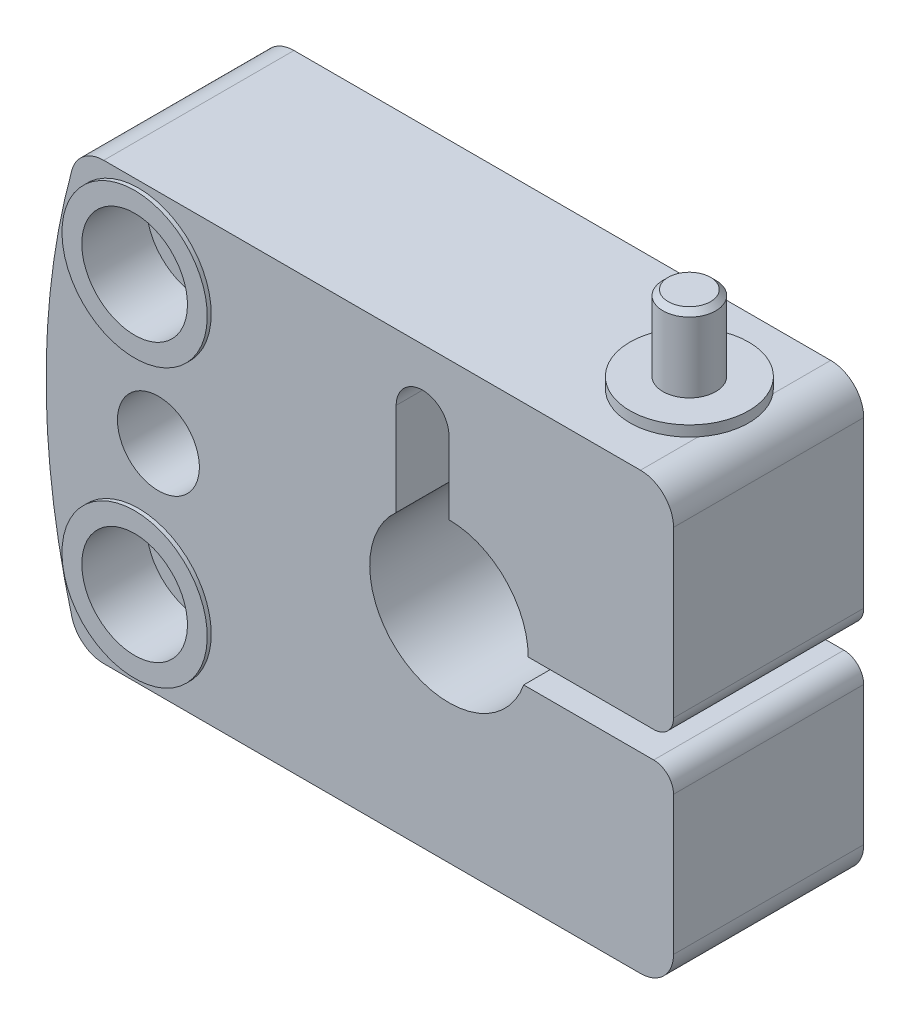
ISO-10303-21;
HEADER;
FILE_DESCRIPTION(('STEP AP214'),'2;1');
FILE_NAME('part.step','',(''),(''),'','','');
FILE_SCHEMA(('AUTOMOTIVE_DESIGN { 1 0 10303 214 1 1 1 1 }'));
ENDSEC;
DATA;
#1=APPLICATION_CONTEXT('core data for automotive mechanical design processes');
#2=APPLICATION_PROTOCOL_DEFINITION('international standard','automotive_design',2000,#1);
#3=PRODUCT_CONTEXT('',#1,'mechanical');
#4=PRODUCT('Part','Part','',(#3));
#5=PRODUCT_RELATED_PRODUCT_CATEGORY('part','',(#4));
#6=PRODUCT_DEFINITION_FORMATION('','',#4);
#7=PRODUCT_DEFINITION_CONTEXT('part definition',#1,'design');
#8=PRODUCT_DEFINITION('design','',#6,#7);
#9=PRODUCT_DEFINITION_SHAPE('','',#8);
#10=(LENGTH_UNIT() NAMED_UNIT(*) SI_UNIT(.MILLI.,.METRE.));
#11=(NAMED_UNIT(*) PLANE_ANGLE_UNIT() SI_UNIT($,.RADIAN.));
#12=(NAMED_UNIT(*) SI_UNIT($,.STERADIAN.) SOLID_ANGLE_UNIT());
#13=UNCERTAINTY_MEASURE_WITH_UNIT(LENGTH_MEASURE(1.E-05),#10,'distance_accuracy_value','');
#14=(GEOMETRIC_REPRESENTATION_CONTEXT(3) GLOBAL_UNCERTAINTY_ASSIGNED_CONTEXT((#13)) GLOBAL_UNIT_ASSIGNED_CONTEXT((#10,
#11,#12)) REPRESENTATION_CONTEXT('',''));
#15=CARTESIAN_POINT('',(0.,0.,0.));
#16=DIRECTION('',(0.,0.,1.));
#17=DIRECTION('',(1.,0.,0.));
#18=AXIS2_PLACEMENT_3D('',#15,#16,#17);
#19=CARTESIAN_POINT('',(14.5,16.5,15.));
#20=DIRECTION('',(0.,-1.,0.));
#21=DIRECTION('',(0.,0.,1.));
#22=AXIS2_PLACEMENT_3D('',#19,#20,#21);
#23=PLANE('',#22);
#24=CARTESIAN_POINT('',(11.,16.5,7.5));
#25=DIRECTION('',(0.,1.,0.));
#26=DIRECTION('',(0.,0.,-1.));
#27=AXIS2_PLACEMENT_3D('',#24,#25,#26);
#28=CIRCLE('',#27,4.5);
#29=CARTESIAN_POINT('',(14.5,16.5,4.67157287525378));
#30=VERTEX_POINT('',#29);
#31=CARTESIAN_POINT('',(14.5,16.5,10.3284271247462));
#32=VERTEX_POINT('',#31);
#33=EDGE_CURVE('E34',#30,#32,#28,.T.);
#34=ORIENTED_EDGE('',*,*,#33,.F.);
#35=DIRECTION('',(0.,0.,-1.));
#36=VECTOR('',#35,1.);
#37=CARTESIAN_POINT('',(14.5,16.5,15.));
#38=LINE('',#37,#36);
#39=CARTESIAN_POINT('',(14.5,16.5,0.3));
#40=VERTEX_POINT('',#39);
#41=EDGE_CURVE('E156',#30,#40,#38,.T.);
#42=ORIENTED_EDGE('',*,*,#41,.T.);
#43=DIRECTION('',(1.,0.,0.));
#44=VECTOR('',#43,1.);
#45=CARTESIAN_POINT('',(-26.1357434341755,16.5,0.3));
#46=LINE('',#45,#44);
#47=CARTESIAN_POINT('',(-26.1357434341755,16.5,0.3));
#48=VERTEX_POINT('',#47);
#49=EDGE_CURVE('E308',#48,#40,#46,.T.);
#50=ORIENTED_EDGE('',*,*,#49,.F.);
#51=DIRECTION('',(0.,0.,-1.));
#52=VECTOR('',#51,1.);
#53=CARTESIAN_POINT('',(-26.1357434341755,16.5,15.));
#54=LINE('',#53,#52);
#55=CARTESIAN_POINT('',(-26.1357434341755,16.5,14.7));
#56=VERTEX_POINT('',#55);
#57=EDGE_CURVE('E347',#56,#48,#54,.T.);
#58=ORIENTED_EDGE('',*,*,#57,.F.);
#59=DIRECTION('',(-1.,0.,0.));
#60=VECTOR('',#59,1.);
#61=CARTESIAN_POINT('',(14.5,16.5,14.7));
#62=LINE('',#61,#60);
#63=CARTESIAN_POINT('',(14.5,16.5,14.7));
#64=VERTEX_POINT('',#63);
#65=EDGE_CURVE('E152',#64,#56,#62,.T.);
#66=ORIENTED_EDGE('',*,*,#65,.F.);
#67=EDGE_CURVE('E149',#64,#32,#38,.T.);
#68=ORIENTED_EDGE('',*,*,#67,.T.);
#69=EDGE_LOOP('',(#34,#42,#50,#58,#66,#68));
#70=FACE_BOUND('',#69,.T.);
#71=ADVANCED_FACE('F18',(#70),#23,.F.);
#72=CARTESIAN_POINT('',(-23.5,10.5,15.));
#73=DIRECTION('',(0.,0.,-1.));
#74=DIRECTION('',(0.,-1.,0.));
#75=AXIS2_PLACEMENT_3D('',#72,#73,#74);
#76=CYLINDRICAL_SURFACE('',#75,2.25);
#77=CARTESIAN_POINT('',(-23.5,10.5,4.9));
#78=DIRECTION('',(0.,0.,-1.));
#79=DIRECTION('',(0.,-1.,0.));
#80=AXIS2_PLACEMENT_3D('',#77,#78,#79);
#81=CIRCLE('',#80,2.25);
#82=CARTESIAN_POINT('',(-23.5,8.25,4.9));
#83=VERTEX_POINT('',#82);
#84=EDGE_CURVE('E207',#83,#83,#81,.T.);
#85=ORIENTED_EDGE('',*,*,#84,.T.);
#86=EDGE_LOOP('',(#85));
#87=FACE_BOUND('',#86,.T.);
#88=CARTESIAN_POINT('',(-23.5,10.5,10.1));
#89=DIRECTION('',(0.,0.,1.));
#90=DIRECTION('',(0.,1.,0.));
#91=AXIS2_PLACEMENT_3D('',#88,#89,#90);
#92=CIRCLE('',#91,2.25);
#93=CARTESIAN_POINT('',(-23.5,12.75,10.1));
#94=VERTEX_POINT('',#93);
#95=EDGE_CURVE('E187',#94,#94,#92,.T.);
#96=ORIENTED_EDGE('',*,*,#95,.T.);
#97=EDGE_LOOP('',(#96));
#98=FACE_BOUND('',#97,.T.);
#99=ADVANCED_FACE('F389',(#87,#98),#76,.F.);
#100=CARTESIAN_POINT('',(-23.5,-10.5,15.));
#101=DIRECTION('',(0.,0.,-1.));
#102=DIRECTION('',(0.,-1.,0.));
#103=AXIS2_PLACEMENT_3D('',#100,#101,#102);
#104=CYLINDRICAL_SURFACE('',#103,2.25);
#105=CARTESIAN_POINT('',(-23.5,-10.5,4.9));
#106=DIRECTION('',(0.,0.,-1.));
#107=DIRECTION('',(0.,-1.,0.));
#108=AXIS2_PLACEMENT_3D('',#105,#106,#107);
#109=CIRCLE('',#108,2.25);
#110=CARTESIAN_POINT('',(-23.5,-12.75,4.9));
#111=VERTEX_POINT('',#110);
#112=EDGE_CURVE('E200',#111,#111,#109,.T.);
#113=ORIENTED_EDGE('',*,*,#112,.T.);
#114=EDGE_LOOP('',(#113));
#115=FACE_BOUND('',#114,.T.);
#116=CARTESIAN_POINT('',(-23.5,-10.5,10.1));
#117=DIRECTION('',(0.,0.,1.));
#118=DIRECTION('',(0.,1.,0.));
#119=AXIS2_PLACEMENT_3D('',#116,#117,#118);
#120=CIRCLE('',#119,2.25);
#121=CARTESIAN_POINT('',(-23.5,-8.25,10.1));
#122=VERTEX_POINT('',#121);
#123=EDGE_CURVE('E193',#122,#122,#120,.T.);
#124=ORIENTED_EDGE('',*,*,#123,.T.);
#125=EDGE_LOOP('',(#124));
#126=FACE_BOUND('',#125,.T.);
#127=ADVANCED_FACE('F395',(#115,#126),#104,.F.);
#128=CARTESIAN_POINT('',(0.,0.,15.));
#129=DIRECTION('',(0.,0.,1.));
#130=DIRECTION('',(0.,1.,0.));
#131=AXIS2_PLACEMENT_3D('',#128,#129,#130);
#132=PLANE('',#131);
#133=CARTESIAN_POINT('',(-23.5,10.5,15.));
#134=DIRECTION('',(0.,0.,1.));
#135=DIRECTION('',(0.,1.,0.));
#136=AXIS2_PLACEMENT_3D('',#133,#134,#135);
#137=CIRCLE('',#136,4.);
#138=CARTESIAN_POINT('',(-23.5,14.5,15.));
#139=VERTEX_POINT('',#138);
#140=EDGE_CURVE('E183',#139,#139,#137,.T.);
#141=ORIENTED_EDGE('',*,*,#140,.F.);
#142=EDGE_LOOP('',(#141));
#143=FACE_BOUND('',#142,.T.);
#144=CARTESIAN_POINT('',(-23.5,10.5,15.));
#145=DIRECTION('',(0.,0.,1.));
#146=DIRECTION('',(0.,1.,0.));
#147=AXIS2_PLACEMENT_3D('',#144,#145,#146);
#148=CIRCLE('',#147,5.5);
#149=CARTESIAN_POINT('',(-23.5,16.,15.));
#150=VERTEX_POINT('',#149);
#151=EDGE_CURVE('E211',#150,#150,#148,.T.);
#152=ORIENTED_EDGE('',*,*,#151,.T.);
#153=EDGE_LOOP('',(#152));
#154=FACE_BOUND('',#153,.T.);
#155=ADVANCED_FACE('F828',(#143,#154),#132,.T.);
#156=CARTESIAN_POINT('',(-23.5,-10.5,15.));
#157=DIRECTION('',(0.,0.,1.));
#158=DIRECTION('',(0.,1.,0.));
#159=AXIS2_PLACEMENT_3D('',#156,#157,#158);
#160=CIRCLE('',#159,4.);
#161=CARTESIAN_POINT('',(-23.5,-6.5,15.));
#162=VERTEX_POINT('',#161);
#163=EDGE_CURVE('E194',#162,#162,#160,.T.);
#164=ORIENTED_EDGE('',*,*,#163,.F.);
#165=EDGE_LOOP('',(#164));
#166=FACE_BOUND('',#165,.T.);
#167=CARTESIAN_POINT('',(-23.5,-10.5,15.));
#168=DIRECTION('',(0.,0.,1.));
#169=DIRECTION('',(0.,1.,0.));
#170=AXIS2_PLACEMENT_3D('',#167,#168,#169);
#171=CIRCLE('',#170,5.5);
#172=CARTESIAN_POINT('',(-23.5,-5.,15.));
#173=VERTEX_POINT('',#172);
#174=EDGE_CURVE('E214',#173,#173,#171,.T.);
#175=ORIENTED_EDGE('',*,*,#174,.T.);
#176=EDGE_LOOP('',(#175));
#177=FACE_BOUND('',#176,.T.);
#178=ADVANCED_FACE('F836',(#166,#177),#132,.T.);
#179=CARTESIAN_POINT('',(0.,0.,0.));
#180=DIRECTION('',(0.,0.,1.));
#181=DIRECTION('',(0.,1.,0.));
#182=AXIS2_PLACEMENT_3D('',#179,#180,#181);
#183=PLANE('',#182);
#184=CARTESIAN_POINT('',(-23.5,10.5,0.));
#185=DIRECTION('',(0.,0.,-1.));
#186=DIRECTION('',(0.,-1.,0.));
#187=AXIS2_PLACEMENT_3D('',#184,#185,#186);
#188=CIRCLE('',#187,4.);
#189=CARTESIAN_POINT('',(-23.5,6.5,0.));
#190=VERTEX_POINT('',#189);
#191=EDGE_CURVE('E208',#190,#190,#188,.T.);
#192=ORIENTED_EDGE('',*,*,#191,.F.);
#193=EDGE_LOOP('',(#192));
#194=FACE_BOUND('',#193,.T.);
#195=CARTESIAN_POINT('',(-23.5,10.5,0.));
#196=DIRECTION('',(0.,0.,-1.));
#197=DIRECTION('',(0.,-1.,0.));
#198=AXIS2_PLACEMENT_3D('',#195,#196,#197);
#199=CIRCLE('',#198,5.5);
#200=CARTESIAN_POINT('',(-23.5,5.,0.));
#201=VERTEX_POINT('',#200);
#202=EDGE_CURVE('E261',#201,#201,#199,.T.);
#203=ORIENTED_EDGE('',*,*,#202,.T.);
#204=EDGE_LOOP('',(#203));
#205=FACE_BOUND('',#204,.T.);
#206=ADVANCED_FACE('F423',(#194,#205),#183,.F.);
#207=CARTESIAN_POINT('',(-23.5,-10.5,0.));
#208=DIRECTION('',(0.,0.,-1.));
#209=DIRECTION('',(0.,-1.,0.));
#210=AXIS2_PLACEMENT_3D('',#207,#208,#209);
#211=CIRCLE('',#210,4.);
#212=CARTESIAN_POINT('',(-23.5,-14.5,0.));
#213=VERTEX_POINT('',#212);
#214=EDGE_CURVE('E201',#213,#213,#211,.T.);
#215=ORIENTED_EDGE('',*,*,#214,.F.);
#216=EDGE_LOOP('',(#215));
#217=FACE_BOUND('',#216,.T.);
#218=CARTESIAN_POINT('',(-23.5,-10.5,0.));
#219=DIRECTION('',(0.,0.,-1.));
#220=DIRECTION('',(0.,-1.,0.));
#221=AXIS2_PLACEMENT_3D('',#218,#219,#220);
#222=CIRCLE('',#221,5.5);
#223=CARTESIAN_POINT('',(-23.5,-16.,0.));
#224=VERTEX_POINT('',#223);
#225=EDGE_CURVE('E222',#224,#224,#222,.T.);
#226=ORIENTED_EDGE('',*,*,#225,.T.);
#227=EDGE_LOOP('',(#226));
#228=FACE_BOUND('',#227,.T.);
#229=ADVANCED_FACE('F417',(#217,#228),#183,.F.);
#230=CARTESIAN_POINT('',(0.,0.,15.));
#231=DIRECTION('',(0.,0.,-1.));
#232=DIRECTION('',(0.,-1.,0.));
#233=AXIS2_PLACEMENT_3D('',#230,#231,#232);
#234=CYLINDRICAL_SURFACE('',#233,6.);
#235=DIRECTION('',(0.,0.,-1.));
#236=VECTOR('',#235,1.);
#237=CARTESIAN_POINT('',(6.,0.,15.));
#238=LINE('',#237,#236);
#239=CARTESIAN_POINT('',(6.,0.,14.7));
#240=VERTEX_POINT('',#239);
#241=CARTESIAN_POINT('',(6.,0.,0.3));
#242=VERTEX_POINT('',#241);
#243=EDGE_CURVE('E354',#240,#242,#238,.T.);
#244=ORIENTED_EDGE('',*,*,#243,.F.);
#245=CARTESIAN_POINT('',(0.,0.,14.7));
#246=DIRECTION('',(0.,0.,-1.));
#247=DIRECTION('',(0.,-1.,0.));
#248=AXIS2_PLACEMENT_3D('',#245,#246,#247);
#249=CIRCLE('',#248,6.);
#250=CARTESIAN_POINT('',(0.,6.,14.7));
#251=VERTEX_POINT('',#250);
#252=EDGE_CURVE('E227',#251,#240,#249,.T.);
#253=ORIENTED_EDGE('',*,*,#252,.F.);
#254=DIRECTION('',(0.,0.,-1.));
#255=VECTOR('',#254,1.);
#256=CARTESIAN_POINT('',(0.,6.,15.));
#257=LINE('',#256,#255);
#258=CARTESIAN_POINT('',(0.,6.,0.3));
#259=VERTEX_POINT('',#258);
#260=EDGE_CURVE('E323',#251,#259,#257,.T.);
#261=ORIENTED_EDGE('',*,*,#260,.T.);
#262=CARTESIAN_POINT('',(0.,0.,0.3));
#263=DIRECTION('',(0.,0.,1.));
#264=DIRECTION('',(0.,-1.,0.));
#265=AXIS2_PLACEMENT_3D('',#262,#263,#264);
#266=CIRCLE('',#265,6.);
#267=EDGE_CURVE('E267',#242,#259,#266,.T.);
#268=ORIENTED_EDGE('',*,*,#267,.F.);
#269=EDGE_LOOP('',(#244,#253,#261,#268));
#270=FACE_BOUND('',#269,.T.);
#271=ADVANCED_FACE('F414',(#270),#234,.F.);
#272=CARTESIAN_POINT('',(6.,0.,15.));
#273=DIRECTION('',(0.,1.,0.));
#274=DIRECTION('',(-1.,0.,0.));
#275=AXIS2_PLACEMENT_3D('',#272,#273,#274);
#276=PLANE('',#275);
#277=CARTESIAN_POINT('',(11.,0.,7.5));
#278=DIRECTION('',(0.,1.,0.));
#279=DIRECTION('',(-1.,0.,0.));
#280=AXIS2_PLACEMENT_3D('',#277,#278,#279);
#281=CIRCLE('',#280,2.);
#282=CARTESIAN_POINT('',(9.,0.,7.5));
#283=VERTEX_POINT('',#282);
#284=EDGE_CURVE('E180',#283,#283,#281,.T.);
#285=ORIENTED_EDGE('',*,*,#284,.T.);
#286=EDGE_LOOP('',(#285));
#287=FACE_BOUND('',#286,.T.);
#288=DIRECTION('',(0.,0.,-1.));
#289=VECTOR('',#288,1.);
#290=CARTESIAN_POINT('',(15.5,0.,15.));
#291=LINE('',#290,#289);
#292=CARTESIAN_POINT('',(15.5,0.,14.7));
#293=VERTEX_POINT('',#292);
#294=CARTESIAN_POINT('',(15.5,0.,0.3));
#295=VERTEX_POINT('',#294);
#296=EDGE_CURVE('E352',#293,#295,#291,.T.);
#297=ORIENTED_EDGE('',*,*,#296,.F.);
#298=DIRECTION('',(1.,0.,0.));
#299=VECTOR('',#298,1.);
#300=CARTESIAN_POINT('',(6.,0.,14.7));
#301=LINE('',#300,#299);
#302=EDGE_CURVE('E215',#240,#293,#301,.T.);
#303=ORIENTED_EDGE('',*,*,#302,.F.);
#304=ORIENTED_EDGE('',*,*,#243,.T.);
#305=DIRECTION('',(-1.,0.,0.));
#306=VECTOR('',#305,1.);
#307=CARTESIAN_POINT('',(15.5,0.,0.3));
#308=LINE('',#307,#306);
#309=EDGE_CURVE('E320',#295,#242,#308,.T.);
#310=ORIENTED_EDGE('',*,*,#309,.F.);
#311=EDGE_LOOP('',(#297,#303,#304,#310));
#312=FACE_BOUND('',#311,.T.);
#313=ADVANCED_FACE('F411',(#287,#312),#276,.F.);
#314=CARTESIAN_POINT('',(15.5,1.5,15.));
#315=DIRECTION('',(0.,0.,-1.));
#316=DIRECTION('',(0.,-1.,0.));
#317=AXIS2_PLACEMENT_3D('',#314,#315,#316);
#318=CYLINDRICAL_SURFACE('',#317,1.5);
#319=DIRECTION('',(0.,0.,-1.));
#320=VECTOR('',#319,1.);
#321=CARTESIAN_POINT('',(17.,1.5,15.));
#322=LINE('',#321,#320);
#323=CARTESIAN_POINT('',(17.,1.5,14.7));
#324=VERTEX_POINT('',#323);
#325=CARTESIAN_POINT('',(17.,1.5,0.3));
#326=VERTEX_POINT('',#325);
#327=EDGE_CURVE('E350',#324,#326,#322,.T.);
#328=ORIENTED_EDGE('',*,*,#327,.F.);
#329=CARTESIAN_POINT('',(15.5,1.5,14.7));
#330=DIRECTION('',(0.,0.,-1.));
#331=DIRECTION('',(0.,-1.,0.));
#332=AXIS2_PLACEMENT_3D('',#329,#330,#331);
#333=CIRCLE('',#332,1.5);
#334=EDGE_CURVE('E226',#293,#324,#333,.F.);
#335=ORIENTED_EDGE('',*,*,#334,.F.);
#336=ORIENTED_EDGE('',*,*,#296,.T.);
#337=CARTESIAN_POINT('',(15.5,1.5,0.3));
#338=DIRECTION('',(0.,0.,-1.));
#339=DIRECTION('',(0.,-1.,0.));
#340=AXIS2_PLACEMENT_3D('',#337,#338,#339);
#341=CIRCLE('',#340,1.5);
#342=EDGE_CURVE('E317',#326,#295,#341,.T.);
#343=ORIENTED_EDGE('',*,*,#342,.F.);
#344=EDGE_LOOP('',(#328,#335,#336,#343));
#345=FACE_BOUND('',#344,.T.);
#346=ADVANCED_FACE('F407',(#345),#318,.T.);
#347=CARTESIAN_POINT('',(17.,1.5,15.));
#348=DIRECTION('',(-1.,0.,0.));
#349=DIRECTION('',(0.,0.,1.));
#350=AXIS2_PLACEMENT_3D('',#347,#348,#349);
#351=PLANE('',#350);
#352=DIRECTION('',(0.,0.,-1.));
#353=VECTOR('',#352,1.);
#354=CARTESIAN_POINT('',(17.,14.,15.));
#355=LINE('',#354,#353);
#356=CARTESIAN_POINT('',(17.,14.,14.7));
#357=VERTEX_POINT('',#356);
#358=CARTESIAN_POINT('',(17.,14.,0.3));
#359=VERTEX_POINT('',#358);
#360=EDGE_CURVE('E155',#357,#359,#355,.T.);
#361=ORIENTED_EDGE('',*,*,#360,.F.);
#362=DIRECTION('',(0.,1.,0.));
#363=VECTOR('',#362,1.);
#364=CARTESIAN_POINT('',(17.,1.5,14.7));
#365=LINE('',#364,#363);
#366=EDGE_CURVE('E255',#324,#357,#365,.T.);
#367=ORIENTED_EDGE('',*,*,#366,.F.);
#368=ORIENTED_EDGE('',*,*,#327,.T.);
#369=DIRECTION('',(0.,-1.,0.));
#370=VECTOR('',#369,1.);
#371=CARTESIAN_POINT('',(17.,14.,0.3));
#372=LINE('',#371,#370);
#373=EDGE_CURVE('E314',#359,#326,#372,.T.);
#374=ORIENTED_EDGE('',*,*,#373,.F.);
#375=EDGE_LOOP('',(#361,#367,#368,#374));
#376=FACE_BOUND('',#375,.T.);
#377=ADVANCED_FACE('F404',(#376),#351,.F.);
#378=CARTESIAN_POINT('',(14.5,14.,15.));
#379=DIRECTION('',(0.,0.,-1.));
#380=DIRECTION('',(0.,-1.,0.));
#381=AXIS2_PLACEMENT_3D('',#378,#379,#380);
#382=CYLINDRICAL_SURFACE('',#381,2.5);
#383=ORIENTED_EDGE('',*,*,#67,.F.);
#384=CARTESIAN_POINT('',(14.5,14.,14.7));
#385=DIRECTION('',(0.,0.,-1.));
#386=DIRECTION('',(0.,-1.,0.));
#387=AXIS2_PLACEMENT_3D('',#384,#385,#386);
#388=CIRCLE('',#387,2.5);
#389=EDGE_CURVE('E253',#357,#64,#388,.F.);
#390=ORIENTED_EDGE('',*,*,#389,.F.);
#391=ORIENTED_EDGE('',*,*,#360,.T.);
#392=CARTESIAN_POINT('',(14.5,14.,0.3));
#393=DIRECTION('',(0.,0.,-1.));
#394=DIRECTION('',(0.,-1.,0.));
#395=AXIS2_PLACEMENT_3D('',#392,#393,#394);
#396=CIRCLE('',#395,2.5);
#397=EDGE_CURVE('E311',#40,#359,#396,.T.);
#398=ORIENTED_EDGE('',*,*,#397,.F.);
#399=ORIENTED_EDGE('',*,*,#41,.F.);
#400=DIRECTION('',(0.,0.,-1.));
#401=VECTOR('',#400,1.);
#402=CARTESIAN_POINT('',(14.5,16.5,15.));
#403=LINE('',#402,#401);
#404=EDGE_CURVE('E159',#32,#30,#403,.T.);
#405=ORIENTED_EDGE('',*,*,#404,.F.);
#406=EDGE_LOOP('',(#383,#390,#391,#398,#399,#405));
#407=FACE_BOUND('',#406,.T.);
#408=ADVANCED_FACE('F160',(#407),#382,.T.);
#409=CARTESIAN_POINT('',(-26.1357434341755,14.,15.));
#410=DIRECTION('',(0.,0.,-1.));
#411=DIRECTION('',(0.,-1.,0.));
#412=AXIS2_PLACEMENT_3D('',#409,#410,#411);
#413=CYLINDRICAL_SURFACE('',#412,2.5);
#414=DIRECTION('',(0.,0.,-1.));
#415=VECTOR('',#414,1.);
#416=CARTESIAN_POINT('',(-28.54862864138,14.6542056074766,15.));
#417=LINE('',#416,#415);
#418=CARTESIAN_POINT('',(-28.54862864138,14.6542056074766,14.7));
#419=VERTEX_POINT('',#418);
#420=CARTESIAN_POINT('',(-28.54862864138,14.6542056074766,0.3));
#421=VERTEX_POINT('',#420);
#422=EDGE_CURVE('E345',#419,#421,#417,.T.);
#423=ORIENTED_EDGE('',*,*,#422,.F.);
#424=CARTESIAN_POINT('',(-26.1357434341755,14.,14.7));
#425=DIRECTION('',(0.,0.,-1.));
#426=DIRECTION('',(0.,-1.,0.));
#427=AXIS2_PLACEMENT_3D('',#424,#425,#426);
#428=CIRCLE('',#427,2.5);
#429=EDGE_CURVE('E250',#56,#419,#428,.F.);
#430=ORIENTED_EDGE('',*,*,#429,.F.);
#431=ORIENTED_EDGE('',*,*,#57,.T.);
#432=CARTESIAN_POINT('',(-26.1357434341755,14.,0.3));
#433=DIRECTION('',(0.,0.,-1.));
#434=DIRECTION('',(0.,-1.,0.));
#435=AXIS2_PLACEMENT_3D('',#432,#433,#434);
#436=CIRCLE('',#435,2.5);
#437=EDGE_CURVE('E305',#421,#48,#436,.T.);
#438=ORIENTED_EDGE('',*,*,#437,.F.);
#439=EDGE_LOOP('',(#423,#430,#431,#438));
#440=FACE_BOUND('',#439,.T.);
#441=ADVANCED_FACE('F400',(#440),#413,.T.);
#442=CARTESIAN_POINT('',(25.5,0.,15.));
#443=DIRECTION('',(0.,0.,-1.));
#444=DIRECTION('',(0.,-1.,0.));
#445=AXIS2_PLACEMENT_3D('',#442,#443,#444);
#446=CYLINDRICAL_SURFACE('',#445,56.);
#447=DIRECTION('',(0.,0.,-1.));
#448=VECTOR('',#447,1.);
#449=CARTESIAN_POINT('',(-28.54862864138,-14.6542056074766,15.));
#450=LINE('',#449,#448);
#451=CARTESIAN_POINT('',(-28.54862864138,-14.6542056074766,14.7));
#452=VERTEX_POINT('',#451);
#453=CARTESIAN_POINT('',(-28.54862864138,-14.6542056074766,0.3));
#454=VERTEX_POINT('',#453);
#455=EDGE_CURVE('E343',#452,#454,#450,.T.);
#456=ORIENTED_EDGE('',*,*,#455,.F.);
#457=CARTESIAN_POINT('',(25.5,0.,14.7));
#458=DIRECTION('',(0.,0.,-1.));
#459=DIRECTION('',(0.,-1.,0.));
#460=AXIS2_PLACEMENT_3D('',#457,#458,#459);
#461=CIRCLE('',#460,56.);
#462=EDGE_CURVE('E248',#419,#452,#461,.F.);
#463=ORIENTED_EDGE('',*,*,#462,.F.);
#464=ORIENTED_EDGE('',*,*,#422,.T.);
#465=CARTESIAN_POINT('',(25.5,0.,0.3));
#466=DIRECTION('',(0.,0.,-1.));
#467=DIRECTION('',(0.,-1.,0.));
#468=AXIS2_PLACEMENT_3D('',#465,#466,#467);
#469=CIRCLE('',#468,56.);
#470=EDGE_CURVE('E302',#454,#421,#469,.T.);
#471=ORIENTED_EDGE('',*,*,#470,.F.);
#472=EDGE_LOOP('',(#456,#463,#464,#471));
#473=FACE_BOUND('',#472,.T.);
#474=ADVANCED_FACE('F454',(#473),#446,.T.);
#475=CARTESIAN_POINT('',(-26.1357434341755,-14.,15.));
#476=DIRECTION('',(0.,0.,-1.));
#477=DIRECTION('',(0.,-1.,0.));
#478=AXIS2_PLACEMENT_3D('',#475,#476,#477);
#479=CYLINDRICAL_SURFACE('',#478,2.5);
#480=DIRECTION('',(0.,0.,-1.));
#481=VECTOR('',#480,1.);
#482=CARTESIAN_POINT('',(-26.1357434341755,-16.5,15.));
#483=LINE('',#482,#481);
#484=CARTESIAN_POINT('',(-26.1357434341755,-16.5,14.7));
#485=VERTEX_POINT('',#484);
#486=CARTESIAN_POINT('',(-26.1357434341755,-16.5,0.3));
#487=VERTEX_POINT('',#486);
#488=EDGE_CURVE('E341',#485,#487,#483,.T.);
#489=ORIENTED_EDGE('',*,*,#488,.F.);
#490=CARTESIAN_POINT('',(-26.1357434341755,-14.,14.7));
#491=DIRECTION('',(0.,0.,-1.));
#492=DIRECTION('',(0.,-1.,0.));
#493=AXIS2_PLACEMENT_3D('',#490,#491,#492);
#494=CIRCLE('',#493,2.5);
#495=EDGE_CURVE('E246',#452,#485,#494,.F.);
#496=ORIENTED_EDGE('',*,*,#495,.F.);
#497=ORIENTED_EDGE('',*,*,#455,.T.);
#498=CARTESIAN_POINT('',(-26.1357434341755,-14.,0.3));
#499=DIRECTION('',(0.,0.,-1.));
#500=DIRECTION('',(0.,-1.,0.));
#501=AXIS2_PLACEMENT_3D('',#498,#499,#500);
#502=CIRCLE('',#501,2.5);
#503=EDGE_CURVE('E299',#487,#454,#502,.T.);
#504=ORIENTED_EDGE('',*,*,#503,.F.);
#505=EDGE_LOOP('',(#489,#496,#497,#504));
#506=FACE_BOUND('',#505,.T.);
#507=ADVANCED_FACE('F459',(#506),#479,.T.);
#508=CARTESIAN_POINT('',(-26.1357434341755,-16.5,15.));
#509=DIRECTION('',(0.,1.,0.));
#510=DIRECTION('',(0.,0.,-1.));
#511=AXIS2_PLACEMENT_3D('',#508,#509,#510);
#512=PLANE('',#511);
#513=DIRECTION('',(0.,0.,-1.));
#514=VECTOR('',#513,1.);
#515=CARTESIAN_POINT('',(14.5,-16.5,15.));
#516=LINE('',#515,#514);
#517=CARTESIAN_POINT('',(14.5,-16.5,14.7));
#518=VERTEX_POINT('',#517);
#519=CARTESIAN_POINT('',(14.5,-16.5,0.3));
#520=VERTEX_POINT('',#519);
#521=EDGE_CURVE('E339',#518,#520,#516,.T.);
#522=ORIENTED_EDGE('',*,*,#521,.F.);
#523=DIRECTION('',(1.,0.,0.));
#524=VECTOR('',#523,1.);
#525=CARTESIAN_POINT('',(-26.1357434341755,-16.5,14.7));
#526=LINE('',#525,#524);
#527=EDGE_CURVE('E244',#485,#518,#526,.T.);
#528=ORIENTED_EDGE('',*,*,#527,.F.);
#529=ORIENTED_EDGE('',*,*,#488,.T.);
#530=DIRECTION('',(-1.,0.,0.));
#531=VECTOR('',#530,1.);
#532=CARTESIAN_POINT('',(14.5,-16.5,0.3));
#533=LINE('',#532,#531);
#534=EDGE_CURVE('E296',#520,#487,#533,.T.);
#535=ORIENTED_EDGE('',*,*,#534,.F.);
#536=EDGE_LOOP('',(#522,#528,#529,#535));
#537=FACE_BOUND('',#536,.T.);
#538=ADVANCED_FACE('F464',(#537),#512,.F.);
#539=CARTESIAN_POINT('',(14.5,-14.,15.));
#540=DIRECTION('',(0.,0.,-1.));
#541=DIRECTION('',(0.,-1.,0.));
#542=AXIS2_PLACEMENT_3D('',#539,#540,#541);
#543=CYLINDRICAL_SURFACE('',#542,2.5);
#544=DIRECTION('',(0.,0.,-1.));
#545=VECTOR('',#544,1.);
#546=CARTESIAN_POINT('',(17.,-14.,15.));
#547=LINE('',#546,#545);
#548=CARTESIAN_POINT('',(17.,-14.,14.7));
#549=VERTEX_POINT('',#548);
#550=CARTESIAN_POINT('',(17.,-14.,0.3));
#551=VERTEX_POINT('',#550);
#552=EDGE_CURVE('E337',#549,#551,#547,.T.);
#553=ORIENTED_EDGE('',*,*,#552,.F.);
#554=CARTESIAN_POINT('',(14.5,-14.,14.7));
#555=DIRECTION('',(0.,0.,-1.));
#556=DIRECTION('',(0.,-1.,0.));
#557=AXIS2_PLACEMENT_3D('',#554,#555,#556);
#558=CIRCLE('',#557,2.5);
#559=EDGE_CURVE('E242',#518,#549,#558,.F.);
#560=ORIENTED_EDGE('',*,*,#559,.F.);
#561=ORIENTED_EDGE('',*,*,#521,.T.);
#562=CARTESIAN_POINT('',(14.5,-14.,0.3));
#563=DIRECTION('',(0.,0.,-1.));
#564=DIRECTION('',(0.,-1.,0.));
#565=AXIS2_PLACEMENT_3D('',#562,#563,#564);
#566=CIRCLE('',#565,2.5);
#567=EDGE_CURVE('E293',#551,#520,#566,.T.);
#568=ORIENTED_EDGE('',*,*,#567,.F.);
#569=EDGE_LOOP('',(#553,#560,#561,#568));
#570=FACE_BOUND('',#569,.T.);
#571=ADVANCED_FACE('F470',(#570),#543,.T.);
#572=CARTESIAN_POINT('',(17.,-14.,15.));
#573=DIRECTION('',(-1.,0.,0.));
#574=DIRECTION('',(0.,0.,1.));
#575=AXIS2_PLACEMENT_3D('',#572,#573,#574);
#576=PLANE('',#575);
#577=DIRECTION('',(0.,0.,-1.));
#578=VECTOR('',#577,1.);
#579=CARTESIAN_POINT('',(17.,-3.5,15.));
#580=LINE('',#579,#578);
#581=CARTESIAN_POINT('',(17.,-3.5,14.7));
#582=VERTEX_POINT('',#581);
#583=CARTESIAN_POINT('',(17.,-3.5,0.3));
#584=VERTEX_POINT('',#583);
#585=EDGE_CURVE('E335',#582,#584,#580,.T.);
#586=ORIENTED_EDGE('',*,*,#585,.F.);
#587=DIRECTION('',(0.,1.,0.));
#588=VECTOR('',#587,1.);
#589=CARTESIAN_POINT('',(17.,-14.,14.7));
#590=LINE('',#589,#588);
#591=EDGE_CURVE('E240',#549,#582,#590,.T.);
#592=ORIENTED_EDGE('',*,*,#591,.F.);
#593=ORIENTED_EDGE('',*,*,#552,.T.);
#594=DIRECTION('',(0.,-1.,0.));
#595=VECTOR('',#594,1.);
#596=CARTESIAN_POINT('',(17.,-3.5,0.3));
#597=LINE('',#596,#595);
#598=EDGE_CURVE('E290',#584,#551,#597,.T.);
#599=ORIENTED_EDGE('',*,*,#598,.F.);
#600=EDGE_LOOP('',(#586,#592,#593,#599));
#601=FACE_BOUND('',#600,.T.);
#602=ADVANCED_FACE('F474',(#601),#576,.F.);
#603=CARTESIAN_POINT('',(15.5,-3.5,15.));
#604=DIRECTION('',(0.,0.,-1.));
#605=DIRECTION('',(0.,-1.,0.));
#606=AXIS2_PLACEMENT_3D('',#603,#604,#605);
#607=CYLINDRICAL_SURFACE('',#606,1.5);
#608=DIRECTION('',(0.,0.,-1.));
#609=VECTOR('',#608,1.);
#610=CARTESIAN_POINT('',(15.5,-2.,15.));
#611=LINE('',#610,#609);
#612=CARTESIAN_POINT('',(15.5,-2.,14.7));
#613=VERTEX_POINT('',#612);
#614=CARTESIAN_POINT('',(15.5,-2.,0.3));
#615=VERTEX_POINT('',#614);
#616=EDGE_CURVE('E333',#613,#615,#611,.T.);
#617=ORIENTED_EDGE('',*,*,#616,.F.);
#618=CARTESIAN_POINT('',(15.5,-3.5,14.7));
#619=DIRECTION('',(0.,0.,-1.));
#620=DIRECTION('',(0.,-1.,0.));
#621=AXIS2_PLACEMENT_3D('',#618,#619,#620);
#622=CIRCLE('',#621,1.5);
#623=EDGE_CURVE('E238',#582,#613,#622,.F.);
#624=ORIENTED_EDGE('',*,*,#623,.F.);
#625=ORIENTED_EDGE('',*,*,#585,.T.);
#626=CARTESIAN_POINT('',(15.5,-3.5,0.3));
#627=DIRECTION('',(0.,0.,-1.));
#628=DIRECTION('',(0.,-1.,0.));
#629=AXIS2_PLACEMENT_3D('',#626,#627,#628);
#630=CIRCLE('',#629,1.5);
#631=EDGE_CURVE('E287',#615,#584,#630,.T.);
#632=ORIENTED_EDGE('',*,*,#631,.F.);
#633=EDGE_LOOP('',(#617,#624,#625,#632));
#634=FACE_BOUND('',#633,.T.);
#635=ADVANCED_FACE('F479',(#634),#607,.T.);
#636=CARTESIAN_POINT('',(15.5,-2.,15.));
#637=DIRECTION('',(0.,-1.,0.));
#638=DIRECTION('',(1.,0.,0.));
#639=AXIS2_PLACEMENT_3D('',#636,#637,#638);
#640=PLANE('',#639);
#641=CARTESIAN_POINT('',(11.,-2.00000000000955,7.5));
#642=DIRECTION('',(0.,-1.,0.));
#643=DIRECTION('',(1.,0.,0.));
#644=AXIS2_PLACEMENT_3D('',#641,#642,#643);
#645=CIRCLE('',#644,2.);
#646=CARTESIAN_POINT('',(13.,-2.00000000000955,7.5));
#647=VERTEX_POINT('',#646);
#648=EDGE_CURVE('E165',#647,#647,#645,.F.);
#649=ORIENTED_EDGE('',*,*,#648,.F.);
#650=EDGE_LOOP('',(#649));
#651=FACE_BOUND('',#650,.T.);
#652=DIRECTION('',(0.,0.,-1.));
#653=VECTOR('',#652,1.);
#654=CARTESIAN_POINT('',(5.6568542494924,-2.,15.));
#655=LINE('',#654,#653);
#656=CARTESIAN_POINT('',(5.6568542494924,-2.,14.7));
#657=VERTEX_POINT('',#656);
#658=CARTESIAN_POINT('',(5.6568542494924,-2.,0.3));
#659=VERTEX_POINT('',#658);
#660=EDGE_CURVE('E331',#657,#659,#655,.T.);
#661=ORIENTED_EDGE('',*,*,#660,.F.);
#662=DIRECTION('',(-1.,0.,0.));
#663=VECTOR('',#662,1.);
#664=CARTESIAN_POINT('',(15.5,-2.,14.7));
#665=LINE('',#664,#663);
#666=EDGE_CURVE('E236',#613,#657,#665,.T.);
#667=ORIENTED_EDGE('',*,*,#666,.F.);
#668=ORIENTED_EDGE('',*,*,#616,.T.);
#669=DIRECTION('',(1.,0.,0.));
#670=VECTOR('',#669,1.);
#671=CARTESIAN_POINT('',(5.6568542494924,-2.,0.3));
#672=LINE('',#671,#670);
#673=EDGE_CURVE('E284',#659,#615,#672,.T.);
#674=ORIENTED_EDGE('',*,*,#673,.F.);
#675=EDGE_LOOP('',(#661,#667,#668,#674));
#676=FACE_BOUND('',#675,.T.);
#677=ADVANCED_FACE('F485',(#651,#676),#640,.F.);
#678=CARTESIAN_POINT('',(0.,0.,15.));
#679=DIRECTION('',(0.,0.,-1.));
#680=DIRECTION('',(0.,-1.,0.));
#681=AXIS2_PLACEMENT_3D('',#678,#679,#680);
#682=CYLINDRICAL_SURFACE('',#681,6.);
#683=DIRECTION('',(0.,0.,-1.));
#684=VECTOR('',#683,1.);
#685=CARTESIAN_POINT('',(-4.,4.47213595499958,15.));
#686=LINE('',#685,#684);
#687=CARTESIAN_POINT('',(-4.,4.47213595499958,14.7));
#688=VERTEX_POINT('',#687);
#689=CARTESIAN_POINT('',(-4.,4.47213595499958,0.3));
#690=VERTEX_POINT('',#689);
#691=EDGE_CURVE('E329',#688,#690,#686,.T.);
#692=ORIENTED_EDGE('',*,*,#691,.F.);
#693=CARTESIAN_POINT('',(0.,0.,14.7));
#694=DIRECTION('',(0.,0.,-1.));
#695=DIRECTION('',(0.,-1.,0.));
#696=AXIS2_PLACEMENT_3D('',#693,#694,#695);
#697=CIRCLE('',#696,6.);
#698=EDGE_CURVE('E234',#657,#688,#697,.T.);
#699=ORIENTED_EDGE('',*,*,#698,.F.);
#700=ORIENTED_EDGE('',*,*,#660,.T.);
#701=CARTESIAN_POINT('',(0.,0.,0.3));
#702=DIRECTION('',(0.,0.,1.));
#703=DIRECTION('',(0.,-1.,0.));
#704=AXIS2_PLACEMENT_3D('',#701,#702,#703);
#705=CIRCLE('',#704,6.);
#706=EDGE_CURVE('E281',#690,#659,#705,.T.);
#707=ORIENTED_EDGE('',*,*,#706,.F.);
#708=EDGE_LOOP('',(#692,#699,#700,#707));
#709=FACE_BOUND('',#708,.T.);
#710=ADVANCED_FACE('F489',(#709),#682,.F.);
#711=CARTESIAN_POINT('',(-4.,11.5,15.));
#712=DIRECTION('',(-1.,0.,0.));
#713=DIRECTION('',(0.,-1.,0.));
#714=AXIS2_PLACEMENT_3D('',#711,#712,#713);
#715=PLANE('',#714);
#716=DIRECTION('',(0.,0.,-1.));
#717=VECTOR('',#716,1.);
#718=CARTESIAN_POINT('',(-4.,11.5,15.));
#719=LINE('',#718,#717);
#720=CARTESIAN_POINT('',(-4.,11.5,14.7));
#721=VERTEX_POINT('',#720);
#722=CARTESIAN_POINT('',(-4.,11.5,0.3));
#723=VERTEX_POINT('',#722);
#724=EDGE_CURVE('E327',#721,#723,#719,.T.);
#725=ORIENTED_EDGE('',*,*,#724,.F.);
#726=DIRECTION('',(0.,1.,0.));
#727=VECTOR('',#726,1.);
#728=CARTESIAN_POINT('',(-4.,4.47213595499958,14.7));
#729=LINE('',#728,#727);
#730=EDGE_CURVE('E232',#688,#721,#729,.T.);
#731=ORIENTED_EDGE('',*,*,#730,.F.);
#732=ORIENTED_EDGE('',*,*,#691,.T.);
#733=DIRECTION('',(0.,-1.,0.));
#734=VECTOR('',#733,1.);
#735=CARTESIAN_POINT('',(-4.,11.5,0.3));
#736=LINE('',#735,#734);
#737=EDGE_CURVE('E278',#723,#690,#736,.T.);
#738=ORIENTED_EDGE('',*,*,#737,.F.);
#739=EDGE_LOOP('',(#725,#731,#732,#738));
#740=FACE_BOUND('',#739,.T.);
#741=ADVANCED_FACE('F494',(#740),#715,.F.);
#742=CARTESIAN_POINT('',(-2.,11.5,15.));
#743=DIRECTION('',(0.,0.,-1.));
#744=DIRECTION('',(0.,-1.,0.));
#745=AXIS2_PLACEMENT_3D('',#742,#743,#744);
#746=CYLINDRICAL_SURFACE('',#745,2.);
#747=DIRECTION('',(0.,0.,-1.));
#748=VECTOR('',#747,1.);
#749=CARTESIAN_POINT('',(0.,11.5,15.));
#750=LINE('',#749,#748);
#751=CARTESIAN_POINT('',(0.,11.5,14.7));
#752=VERTEX_POINT('',#751);
#753=CARTESIAN_POINT('',(0.,11.5,0.3));
#754=VERTEX_POINT('',#753);
#755=EDGE_CURVE('E325',#752,#754,#750,.T.);
#756=ORIENTED_EDGE('',*,*,#755,.F.);
#757=CARTESIAN_POINT('',(-2.,11.5,14.7));
#758=DIRECTION('',(0.,0.,-1.));
#759=DIRECTION('',(0.,-1.,0.));
#760=AXIS2_PLACEMENT_3D('',#757,#758,#759);
#761=CIRCLE('',#760,2.);
#762=EDGE_CURVE('E42',#721,#752,#761,.T.);
#763=ORIENTED_EDGE('',*,*,#762,.F.);
#764=ORIENTED_EDGE('',*,*,#724,.T.);
#765=CARTESIAN_POINT('',(-2.,11.5,0.3));
#766=DIRECTION('',(0.,0.,1.));
#767=DIRECTION('',(0.,-1.,0.));
#768=AXIS2_PLACEMENT_3D('',#765,#766,#767);
#769=CIRCLE('',#768,2.);
#770=EDGE_CURVE('E275',#754,#723,#769,.T.);
#771=ORIENTED_EDGE('',*,*,#770,.F.);
#772=EDGE_LOOP('',(#756,#763,#764,#771));
#773=FACE_BOUND('',#772,.T.);
#774=ADVANCED_FACE('F498',(#773),#746,.F.);
#775=CARTESIAN_POINT('',(0.,6.,15.));
#776=DIRECTION('',(1.,0.,0.));
#777=DIRECTION('',(0.,0.,-1.));
#778=AXIS2_PLACEMENT_3D('',#775,#776,#777);
#779=PLANE('',#778);
#780=ORIENTED_EDGE('',*,*,#260,.F.);
#781=DIRECTION('',(0.,-1.,0.));
#782=VECTOR('',#781,1.);
#783=CARTESIAN_POINT('',(0.,11.5,14.7));
#784=LINE('',#783,#782);
#785=EDGE_CURVE('E229',#752,#251,#784,.T.);
#786=ORIENTED_EDGE('',*,*,#785,.F.);
#787=ORIENTED_EDGE('',*,*,#755,.T.);
#788=DIRECTION('',(0.,1.,0.));
#789=VECTOR('',#788,1.);
#790=CARTESIAN_POINT('',(0.,6.,0.3));
#791=LINE('',#790,#789);
#792=EDGE_CURVE('E272',#259,#754,#791,.T.);
#793=ORIENTED_EDGE('',*,*,#792,.F.);
#794=EDGE_LOOP('',(#780,#786,#787,#793));
#795=FACE_BOUND('',#794,.T.);
#796=ADVANCED_FACE('F500',(#795),#779,.F.);
#797=CARTESIAN_POINT('',(0.,0.,0.3));
#798=DIRECTION('',(0.,0.,-1.));
#799=DIRECTION('',(0.,-1.,0.));
#800=AXIS2_PLACEMENT_3D('',#797,#798,#799);
#801=PLANE('',#800);
#802=CARTESIAN_POINT('',(-22.,0.,0.3));
#803=DIRECTION('',(0.,0.,-1.));
#804=DIRECTION('',(-1.,0.,0.));
#805=AXIS2_PLACEMENT_3D('',#802,#803,#804);
#806=CIRCLE('',#805,3.1);
#807=CARTESIAN_POINT('',(-25.1,0.,0.3));
#808=VERTEX_POINT('',#807);
#809=EDGE_CURVE('E171',#808,#808,#806,.F.);
#810=ORIENTED_EDGE('',*,*,#809,.T.);
#811=EDGE_LOOP('',(#810));
#812=FACE_BOUND('',#811,.T.);
#813=CARTESIAN_POINT('',(-23.5,-10.5,0.3));
#814=DIRECTION('',(0.,0.,-1.));
#815=DIRECTION('',(0.,-1.,0.));
#816=AXIS2_PLACEMENT_3D('',#813,#814,#815);
#817=CIRCLE('',#816,5.5);
#818=CARTESIAN_POINT('',(-23.5,-16.,0.3));
#819=VERTEX_POINT('',#818);
#820=EDGE_CURVE('E258',#819,#819,#817,.T.);
#821=ORIENTED_EDGE('',*,*,#820,.F.);
#822=EDGE_LOOP('',(#821));
#823=FACE_BOUND('',#822,.T.);
#824=CARTESIAN_POINT('',(-23.5,10.5,0.3));
#825=DIRECTION('',(0.,0.,-1.));
#826=DIRECTION('',(0.,-1.,0.));
#827=AXIS2_PLACEMENT_3D('',#824,#825,#826);
#828=CIRCLE('',#827,5.5);
#829=CARTESIAN_POINT('',(-23.5,5.,0.3));
#830=VERTEX_POINT('',#829);
#831=EDGE_CURVE('E264',#830,#830,#828,.T.);
#832=ORIENTED_EDGE('',*,*,#831,.F.);
#833=EDGE_LOOP('',(#832));
#834=FACE_BOUND('',#833,.T.);
#835=ORIENTED_EDGE('',*,*,#267,.T.);
#836=ORIENTED_EDGE('',*,*,#792,.T.);
#837=ORIENTED_EDGE('',*,*,#770,.T.);
#838=ORIENTED_EDGE('',*,*,#737,.T.);
#839=ORIENTED_EDGE('',*,*,#706,.T.);
#840=ORIENTED_EDGE('',*,*,#673,.T.);
#841=ORIENTED_EDGE('',*,*,#631,.T.);
#842=ORIENTED_EDGE('',*,*,#598,.T.);
#843=ORIENTED_EDGE('',*,*,#567,.T.);
#844=ORIENTED_EDGE('',*,*,#534,.T.);
#845=ORIENTED_EDGE('',*,*,#503,.T.);
#846=ORIENTED_EDGE('',*,*,#470,.T.);
#847=ORIENTED_EDGE('',*,*,#437,.T.);
#848=ORIENTED_EDGE('',*,*,#49,.T.);
#849=ORIENTED_EDGE('',*,*,#397,.T.);
#850=ORIENTED_EDGE('',*,*,#373,.T.);
#851=ORIENTED_EDGE('',*,*,#342,.T.);
#852=ORIENTED_EDGE('',*,*,#309,.T.);
#853=EDGE_LOOP('',(#835,#836,#837,#838,#839,#840,#841,#842,#843,#844,#845,#846,#847,#848,#849,
#850,#851,#852));
#854=FACE_BOUND('',#853,.T.);
#855=ADVANCED_FACE('F435',(#812,#823,#834,#854),#801,.T.);
#856=CARTESIAN_POINT('',(-23.5,10.5,0.3));
#857=DIRECTION('',(0.,0.,-1.));
#858=DIRECTION('',(0.,-1.,0.));
#859=AXIS2_PLACEMENT_3D('',#856,#857,#858);
#860=CYLINDRICAL_SURFACE('',#859,5.5);
#861=ORIENTED_EDGE('',*,*,#831,.T.);
#862=EDGE_LOOP('',(#861));
#863=FACE_BOUND('',#862,.T.);
#864=ORIENTED_EDGE('',*,*,#202,.F.);
#865=EDGE_LOOP('',(#864));
#866=FACE_BOUND('',#865,.T.);
#867=ADVANCED_FACE('F508',(#863,#866),#860,.T.);
#868=CARTESIAN_POINT('',(-23.5,-10.5,0.3));
#869=DIRECTION('',(0.,0.,-1.));
#870=DIRECTION('',(0.,-1.,0.));
#871=AXIS2_PLACEMENT_3D('',#868,#869,#870);
#872=CYLINDRICAL_SURFACE('',#871,5.5);
#873=ORIENTED_EDGE('',*,*,#820,.T.);
#874=EDGE_LOOP('',(#873));
#875=FACE_BOUND('',#874,.T.);
#876=ORIENTED_EDGE('',*,*,#225,.F.);
#877=EDGE_LOOP('',(#876));
#878=FACE_BOUND('',#877,.T.);
#879=ADVANCED_FACE('F656',(#875,#878),#872,.T.);
#880=CARTESIAN_POINT('',(-23.5,10.5,-57.538136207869));
#881=DIRECTION('',(0.,0.,1.));
#882=DIRECTION('',(0.,1.,0.));
#883=AXIS2_PLACEMENT_3D('',#880,#881,#882);
#884=CYLINDRICAL_SURFACE('',#883,5.5);
#885=ORIENTED_EDGE('',*,*,#151,.F.);
#886=EDGE_LOOP('',(#885));
#887=FACE_BOUND('',#886,.T.);
#888=CARTESIAN_POINT('',(-23.5,10.5,14.7));
#889=DIRECTION('',(0.,0.,-1.));
#890=DIRECTION('',(0.,-1.,0.));
#891=AXIS2_PLACEMENT_3D('',#888,#889,#890);
#892=CIRCLE('',#891,5.5);
#893=CARTESIAN_POINT('',(-23.5,5.,14.7));
#894=VERTEX_POINT('',#893);
#895=EDGE_CURVE('E219',#894,#894,#892,.F.);
#896=ORIENTED_EDGE('',*,*,#895,.T.);
#897=EDGE_LOOP('',(#896));
#898=FACE_BOUND('',#897,.T.);
#899=ADVANCED_FACE('F664',(#887,#898),#884,.T.);
#900=CARTESIAN_POINT('',(-23.5,-10.5,-57.538136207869));
#901=DIRECTION('',(0.,0.,1.));
#902=DIRECTION('',(0.,1.,0.));
#903=AXIS2_PLACEMENT_3D('',#900,#901,#902);
#904=CYLINDRICAL_SURFACE('',#903,5.5);
#905=ORIENTED_EDGE('',*,*,#174,.F.);
#906=EDGE_LOOP('',(#905));
#907=FACE_BOUND('',#906,.T.);
#908=CARTESIAN_POINT('',(-23.5,-10.5,14.7));
#909=DIRECTION('',(0.,0.,-1.));
#910=DIRECTION('',(0.,-1.,0.));
#911=AXIS2_PLACEMENT_3D('',#908,#909,#910);
#912=CIRCLE('',#911,5.5);
#913=CARTESIAN_POINT('',(-23.5,-16.,14.7));
#914=VERTEX_POINT('',#913);
#915=EDGE_CURVE('E218',#914,#914,#912,.F.);
#916=ORIENTED_EDGE('',*,*,#915,.T.);
#917=EDGE_LOOP('',(#916));
#918=FACE_BOUND('',#917,.T.);
#919=ADVANCED_FACE('F673',(#907,#918),#904,.T.);
#920=CARTESIAN_POINT('',(0.,0.,14.7));
#921=DIRECTION('',(0.,0.,-1.));
#922=DIRECTION('',(0.,-1.,0.));
#923=AXIS2_PLACEMENT_3D('',#920,#921,#922);
#924=PLANE('',#923);
#925=CARTESIAN_POINT('',(-22.,0.,14.7));
#926=DIRECTION('',(0.,0.,-1.));
#927=DIRECTION('',(-1.,0.,0.));
#928=AXIS2_PLACEMENT_3D('',#925,#926,#927);
#929=CIRCLE('',#928,3.1);
#930=CARTESIAN_POINT('',(-25.1,0.,14.7));
#931=VERTEX_POINT('',#930);
#932=EDGE_CURVE('E22',#931,#931,#929,.F.);
#933=ORIENTED_EDGE('',*,*,#932,.F.);
#934=EDGE_LOOP('',(#933));
#935=FACE_BOUND('',#934,.T.);
#936=ORIENTED_EDGE('',*,*,#252,.T.);
#937=ORIENTED_EDGE('',*,*,#302,.T.);
#938=ORIENTED_EDGE('',*,*,#334,.T.);
#939=ORIENTED_EDGE('',*,*,#366,.T.);
#940=ORIENTED_EDGE('',*,*,#389,.T.);
#941=ORIENTED_EDGE('',*,*,#65,.T.);
#942=ORIENTED_EDGE('',*,*,#429,.T.);
#943=ORIENTED_EDGE('',*,*,#462,.T.);
#944=ORIENTED_EDGE('',*,*,#495,.T.);
#945=ORIENTED_EDGE('',*,*,#527,.T.);
#946=ORIENTED_EDGE('',*,*,#559,.T.);
#947=ORIENTED_EDGE('',*,*,#591,.T.);
#948=ORIENTED_EDGE('',*,*,#623,.T.);
#949=ORIENTED_EDGE('',*,*,#666,.T.);
#950=ORIENTED_EDGE('',*,*,#698,.T.);
#951=ORIENTED_EDGE('',*,*,#730,.T.);
#952=ORIENTED_EDGE('',*,*,#762,.T.);
#953=ORIENTED_EDGE('',*,*,#785,.T.);
#954=EDGE_LOOP('',(#936,#937,#938,#939,#940,#941,#942,#943,#944,#945,#946,#947,#948,#949,#950,
#951,#952,#953));
#955=FACE_BOUND('',#954,.T.);
#956=ORIENTED_EDGE('',*,*,#915,.F.);
#957=EDGE_LOOP('',(#956));
#958=FACE_BOUND('',#957,.T.);
#959=ORIENTED_EDGE('',*,*,#895,.F.);
#960=EDGE_LOOP('',(#959));
#961=FACE_BOUND('',#960,.T.);
#962=ADVANCED_FACE('F442',(#935,#955,#958,#961),#924,.F.);
#963=CARTESIAN_POINT('',(-23.5,10.5,4.9));
#964=DIRECTION('',(0.,0.,-1.));
#965=DIRECTION('',(0.,-1.,0.));
#966=AXIS2_PLACEMENT_3D('',#963,#964,#965);
#967=CYLINDRICAL_SURFACE('',#966,4.);
#968=CARTESIAN_POINT('',(-23.5,10.5,4.9));
#969=DIRECTION('',(0.,0.,-1.));
#970=DIRECTION('',(0.,-1.,0.));
#971=AXIS2_PLACEMENT_3D('',#968,#969,#970);
#972=CIRCLE('',#971,4.);
#973=CARTESIAN_POINT('',(-23.5,6.5,4.9));
#974=VERTEX_POINT('',#973);
#975=EDGE_CURVE('E204',#974,#974,#972,.T.);
#976=ORIENTED_EDGE('',*,*,#975,.F.);
#977=EDGE_LOOP('',(#976));
#978=FACE_BOUND('',#977,.T.);
#979=ORIENTED_EDGE('',*,*,#191,.T.);
#980=EDGE_LOOP('',(#979));
#981=FACE_BOUND('',#980,.T.);
#982=ADVANCED_FACE('F691',(#978,#981),#967,.F.);
#983=CARTESIAN_POINT('',(-23.5,10.5,4.9));
#984=DIRECTION('',(0.,0.,-1.));
#985=DIRECTION('',(0.,-1.,0.));
#986=AXIS2_PLACEMENT_3D('',#983,#984,#985);
#987=PLANE('',#986);
#988=ORIENTED_EDGE('',*,*,#84,.F.);
#989=EDGE_LOOP('',(#988));
#990=FACE_BOUND('',#989,.T.);
#991=ORIENTED_EDGE('',*,*,#975,.T.);
#992=EDGE_LOOP('',(#991));
#993=FACE_BOUND('',#992,.T.);
#994=ADVANCED_FACE('F700',(#990,#993),#987,.T.);
#995=CARTESIAN_POINT('',(-23.5,-10.5,4.9));
#996=DIRECTION('',(0.,0.,-1.));
#997=DIRECTION('',(0.,-1.,0.));
#998=AXIS2_PLACEMENT_3D('',#995,#996,#997);
#999=CYLINDRICAL_SURFACE('',#998,4.);
#1000=CARTESIAN_POINT('',(-23.5,-10.5,4.9));
#1001=DIRECTION('',(0.,0.,-1.));
#1002=DIRECTION('',(0.,-1.,0.));
#1003=AXIS2_PLACEMENT_3D('',#1000,#1001,#1002);
#1004=CIRCLE('',#1003,4.);
#1005=CARTESIAN_POINT('',(-23.5,-14.5,4.9));
#1006=VERTEX_POINT('',#1005);
#1007=EDGE_CURVE('E197',#1006,#1006,#1004,.T.);
#1008=ORIENTED_EDGE('',*,*,#1007,.F.);
#1009=EDGE_LOOP('',(#1008));
#1010=FACE_BOUND('',#1009,.T.);
#1011=ORIENTED_EDGE('',*,*,#214,.T.);
#1012=EDGE_LOOP('',(#1011));
#1013=FACE_BOUND('',#1012,.T.);
#1014=ADVANCED_FACE('F709',(#1010,#1013),#999,.F.);
#1015=CARTESIAN_POINT('',(-23.5,-10.5,4.9));
#1016=DIRECTION('',(0.,0.,-1.));
#1017=DIRECTION('',(0.,-1.,0.));
#1018=AXIS2_PLACEMENT_3D('',#1015,#1016,#1017);
#1019=PLANE('',#1018);
#1020=ORIENTED_EDGE('',*,*,#112,.F.);
#1021=EDGE_LOOP('',(#1020));
#1022=FACE_BOUND('',#1021,.T.);
#1023=ORIENTED_EDGE('',*,*,#1007,.T.);
#1024=EDGE_LOOP('',(#1023));
#1025=FACE_BOUND('',#1024,.T.);
#1026=ADVANCED_FACE('F718',(#1022,#1025),#1019,.T.);
#1027=CARTESIAN_POINT('',(-23.5,-10.5,10.1));
#1028=DIRECTION('',(0.,0.,1.));
#1029=DIRECTION('',(0.,1.,0.));
#1030=AXIS2_PLACEMENT_3D('',#1027,#1028,#1029);
#1031=CYLINDRICAL_SURFACE('',#1030,4.);
#1032=CARTESIAN_POINT('',(-23.5,-10.5,10.1));
#1033=DIRECTION('',(0.,0.,1.));
#1034=DIRECTION('',(0.,1.,0.));
#1035=AXIS2_PLACEMENT_3D('',#1032,#1033,#1034);
#1036=CIRCLE('',#1035,4.);
#1037=CARTESIAN_POINT('',(-23.5,-6.5,10.1));
#1038=VERTEX_POINT('',#1037);
#1039=EDGE_CURVE('E190',#1038,#1038,#1036,.T.);
#1040=ORIENTED_EDGE('',*,*,#1039,.F.);
#1041=EDGE_LOOP('',(#1040));
#1042=FACE_BOUND('',#1041,.T.);
#1043=ORIENTED_EDGE('',*,*,#163,.T.);
#1044=EDGE_LOOP('',(#1043));
#1045=FACE_BOUND('',#1044,.T.);
#1046=ADVANCED_FACE('F727',(#1042,#1045),#1031,.F.);
#1047=CARTESIAN_POINT('',(-23.5,-10.5,10.1));
#1048=DIRECTION('',(0.,0.,1.));
#1049=DIRECTION('',(0.,1.,0.));
#1050=AXIS2_PLACEMENT_3D('',#1047,#1048,#1049);
#1051=PLANE('',#1050);
#1052=ORIENTED_EDGE('',*,*,#123,.F.);
#1053=EDGE_LOOP('',(#1052));
#1054=FACE_BOUND('',#1053,.T.);
#1055=ORIENTED_EDGE('',*,*,#1039,.T.);
#1056=EDGE_LOOP('',(#1055));
#1057=FACE_BOUND('',#1056,.T.);
#1058=ADVANCED_FACE('F736',(#1054,#1057),#1051,.T.);
#1059=CARTESIAN_POINT('',(-23.5,10.5,10.1));
#1060=DIRECTION('',(0.,0.,1.));
#1061=DIRECTION('',(0.,1.,0.));
#1062=AXIS2_PLACEMENT_3D('',#1059,#1060,#1061);
#1063=CYLINDRICAL_SURFACE('',#1062,4.);
#1064=CARTESIAN_POINT('',(-23.5,10.5,10.1));
#1065=DIRECTION('',(0.,0.,1.));
#1066=DIRECTION('',(0.,1.,0.));
#1067=AXIS2_PLACEMENT_3D('',#1064,#1065,#1066);
#1068=CIRCLE('',#1067,4.);
#1069=CARTESIAN_POINT('',(-23.5,14.5,10.1));
#1070=VERTEX_POINT('',#1069);
#1071=EDGE_CURVE('E184',#1070,#1070,#1068,.T.);
#1072=ORIENTED_EDGE('',*,*,#1071,.F.);
#1073=EDGE_LOOP('',(#1072));
#1074=FACE_BOUND('',#1073,.T.);
#1075=ORIENTED_EDGE('',*,*,#140,.T.);
#1076=EDGE_LOOP('',(#1075));
#1077=FACE_BOUND('',#1076,.T.);
#1078=ADVANCED_FACE('F745',(#1074,#1077),#1063,.F.);
#1079=CARTESIAN_POINT('',(-23.5,10.5,10.1));
#1080=DIRECTION('',(0.,0.,1.));
#1081=DIRECTION('',(0.,1.,0.));
#1082=AXIS2_PLACEMENT_3D('',#1079,#1080,#1081);
#1083=PLANE('',#1082);
#1084=ORIENTED_EDGE('',*,*,#95,.F.);
#1085=EDGE_LOOP('',(#1084));
#1086=FACE_BOUND('',#1085,.T.);
#1087=ORIENTED_EDGE('',*,*,#1071,.T.);
#1088=EDGE_LOOP('',(#1087));
#1089=FACE_BOUND('',#1088,.T.);
#1090=ADVANCED_FACE('F754',(#1086,#1089),#1083,.T.);
#1091=CARTESIAN_POINT('',(11.,-500000.,7.5));
#1092=DIRECTION('',(0.,1.,0.));
#1093=DIRECTION('',(0.,0.,-1.));
#1094=AXIS2_PLACEMENT_3D('',#1091,#1092,#1093);
#1095=CYLINDRICAL_SURFACE('',#1094,2.);
#1096=ORIENTED_EDGE('',*,*,#648,.T.);
#1097=EDGE_LOOP('',(#1096));
#1098=FACE_BOUND('',#1097,.T.);
#1099=ORIENTED_EDGE('',*,*,#284,.F.);
#1100=EDGE_LOOP('',(#1099));
#1101=FACE_BOUND('',#1100,.T.);
#1102=ADVANCED_FACE('F386',(#1098,#1101),#1095,.T.);
#1103=CARTESIAN_POINT('',(11.,16.5,7.5));
#1104=DIRECTION('',(0.,1.,0.));
#1105=DIRECTION('',(0.,0.,-1.));
#1106=AXIS2_PLACEMENT_3D('',#1103,#1104,#1105);
#1107=PLANE('',#1106);
#1108=EDGE_CURVE('E170',#32,#30,#28,.T.);
#1109=ORIENTED_EDGE('',*,*,#1108,.F.);
#1110=ORIENTED_EDGE('',*,*,#404,.T.);
#1111=EDGE_LOOP('',(#1109,#1110));
#1112=FACE_BOUND('',#1111,.T.);
#1113=ADVANCED_FACE('F173',(#1112),#1107,.F.);
#1114=CARTESIAN_POINT('',(11.,17.3,7.5));
#1115=DIRECTION('',(0.,-1.,0.));
#1116=DIRECTION('',(0.,0.,1.));
#1117=AXIS2_PLACEMENT_3D('',#1114,#1115,#1116);
#1118=CYLINDRICAL_SURFACE('',#1117,4.5);
#1119=CARTESIAN_POINT('',(11.,17.3,7.5));
#1120=DIRECTION('',(0.,1.,0.));
#1121=DIRECTION('',(0.,0.,-1.));
#1122=AXIS2_PLACEMENT_3D('',#1119,#1120,#1121);
#1123=CIRCLE('',#1122,4.5);
#1124=CARTESIAN_POINT('',(11.,17.3,3.));
#1125=VERTEX_POINT('',#1124);
#1126=EDGE_CURVE('E166',#1125,#1125,#1123,.T.);
#1127=ORIENTED_EDGE('',*,*,#1126,.F.);
#1128=EDGE_LOOP('',(#1127));
#1129=FACE_BOUND('',#1128,.T.);
#1130=ORIENTED_EDGE('',*,*,#1108,.T.);
#1131=ORIENTED_EDGE('',*,*,#33,.T.);
#1132=EDGE_LOOP('',(#1130,#1131));
#1133=FACE_BOUND('',#1132,.T.);
#1134=ADVANCED_FACE('F169',(#1129,#1133),#1118,.T.);
#1135=CARTESIAN_POINT('',(11.,17.3,7.5));
#1136=DIRECTION('',(0.,1.,0.));
#1137=DIRECTION('',(0.,0.,-1.));
#1138=AXIS2_PLACEMENT_3D('',#1135,#1136,#1137);
#1139=PLANE('',#1138);
#1140=CARTESIAN_POINT('',(11.,17.2999999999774,7.5));
#1141=DIRECTION('',(0.,1.,0.));
#1142=DIRECTION('',(0.,0.,-1.));
#1143=AXIS2_PLACEMENT_3D('',#1140,#1141,#1142);
#1144=CIRCLE('',#1143,2.);
#1145=CARTESIAN_POINT('',(11.,17.2999999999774,5.5));
#1146=VERTEX_POINT('',#1145);
#1147=EDGE_CURVE('E356',#1146,#1146,#1144,.F.);
#1148=ORIENTED_EDGE('',*,*,#1147,.T.);
#1149=EDGE_LOOP('',(#1148));
#1150=FACE_BOUND('',#1149,.T.);
#1151=ORIENTED_EDGE('',*,*,#1126,.T.);
#1152=EDGE_LOOP('',(#1151));
#1153=FACE_BOUND('',#1152,.T.);
#1154=ADVANCED_FACE('F785',(#1150,#1153),#1139,.T.);
#1155=CARTESIAN_POINT('',(11.,23.,7.5));
#1156=DIRECTION('',(0.,1.,0.));
#1157=DIRECTION('',(0.,0.,-1.));
#1158=AXIS2_PLACEMENT_3D('',#1155,#1156,#1157);
#1159=PLANE('',#1158);
#1160=CARTESIAN_POINT('',(11.,23.,7.5));
#1161=DIRECTION('',(0.,1.,0.));
#1162=DIRECTION('',(0.,0.,-1.));
#1163=AXIS2_PLACEMENT_3D('',#1160,#1161,#1162);
#1164=CIRCLE('',#1163,1.59999999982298);
#1165=CARTESIAN_POINT('',(11.,23.,5.90000000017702));
#1166=VERTEX_POINT('',#1165);
#1167=EDGE_CURVE('E27',#1166,#1166,#1164,.T.);
#1168=ORIENTED_EDGE('',*,*,#1167,.T.);
#1169=EDGE_LOOP('',(#1168));
#1170=FACE_BOUND('',#1169,.T.);
#1171=ADVANCED_FACE('F370',(#1170),#1159,.T.);
#1172=CARTESIAN_POINT('',(11.,22.5999999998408,7.5));
#1173=DIRECTION('',(0.,1.,0.));
#1174=DIRECTION('',(0.,0.,-1.));
#1175=AXIS2_PLACEMENT_3D('',#1172,#1173,#1174);
#1176=CIRCLE('',#1175,2.);
#1177=CARTESIAN_POINT('',(11.,22.5999999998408,5.5));
#1178=VERTEX_POINT('',#1177);
#1179=EDGE_CURVE('E12',#1178,#1178,#1176,.F.);
#1180=ORIENTED_EDGE('',*,*,#1179,.T.);
#1181=EDGE_LOOP('',(#1180));
#1182=FACE_BOUND('',#1181,.T.);
#1183=ORIENTED_EDGE('',*,*,#1147,.F.);
#1184=EDGE_LOOP('',(#1183));
#1185=FACE_BOUND('',#1184,.T.);
#1186=ADVANCED_FACE('F374',(#1182,#1185),#1095,.T.);
#1187=CARTESIAN_POINT('',(11.,23.0000000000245,7.5));
#1188=DIRECTION('',(0.,-1.,0.));
#1189=DIRECTION('',(0.,0.,1.));
#1190=AXIS2_PLACEMENT_3D('',#1187,#1188,#1189);
#1191=CONICAL_SURFACE('',#1190,1.59999999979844,0.785398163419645);
#1192=ORIENTED_EDGE('',*,*,#1179,.F.);
#1193=EDGE_LOOP('',(#1192));
#1194=FACE_BOUND('',#1193,.T.);
#1195=ORIENTED_EDGE('',*,*,#1167,.F.);
#1196=EDGE_LOOP('',(#1195));
#1197=FACE_BOUND('',#1196,.T.);
#1198=ADVANCED_FACE('F20',(#1194,#1197),#1191,.T.);
#1199=CARTESIAN_POINT('',(-22.,0.,15.));
#1200=DIRECTION('',(0.,0.,-1.));
#1201=DIRECTION('',(-1.,0.,0.));
#1202=AXIS2_PLACEMENT_3D('',#1199,#1200,#1201);
#1203=CYLINDRICAL_SURFACE('',#1202,3.1);
#1204=ORIENTED_EDGE('',*,*,#809,.F.);
#1205=EDGE_LOOP('',(#1204));
#1206=FACE_BOUND('',#1205,.T.);
#1207=ORIENTED_EDGE('',*,*,#932,.T.);
#1208=EDGE_LOOP('',(#1207));
#1209=FACE_BOUND('',#1208,.T.);
#1210=ADVANCED_FACE('F373',(#1206,#1209),#1203,.F.);
#1211=CLOSED_SHELL('',(#71,#99,#127,#155,#178,#206,#229,#271,#313,#346,#377,#408,#441,#474,#507,
#538,#571,#602,#635,#677,#710,#741,#774,#796,#855,#867,#879,#899,#919,#962,#982,#994,#1014,
#1026,#1046,#1058,#1078,#1090,#1102,#1113,#1134,#1154,#1171,#1186,#1198,#1210));
#1212=MANIFOLD_SOLID_BREP('B1',#1211);
#1213=ADVANCED_BREP_SHAPE_REPRESENTATION('',(#18,#1212),#14);
#1214=SHAPE_DEFINITION_REPRESENTATION(#9,#1213);
ENDSEC;
END-ISO-10303-21;
